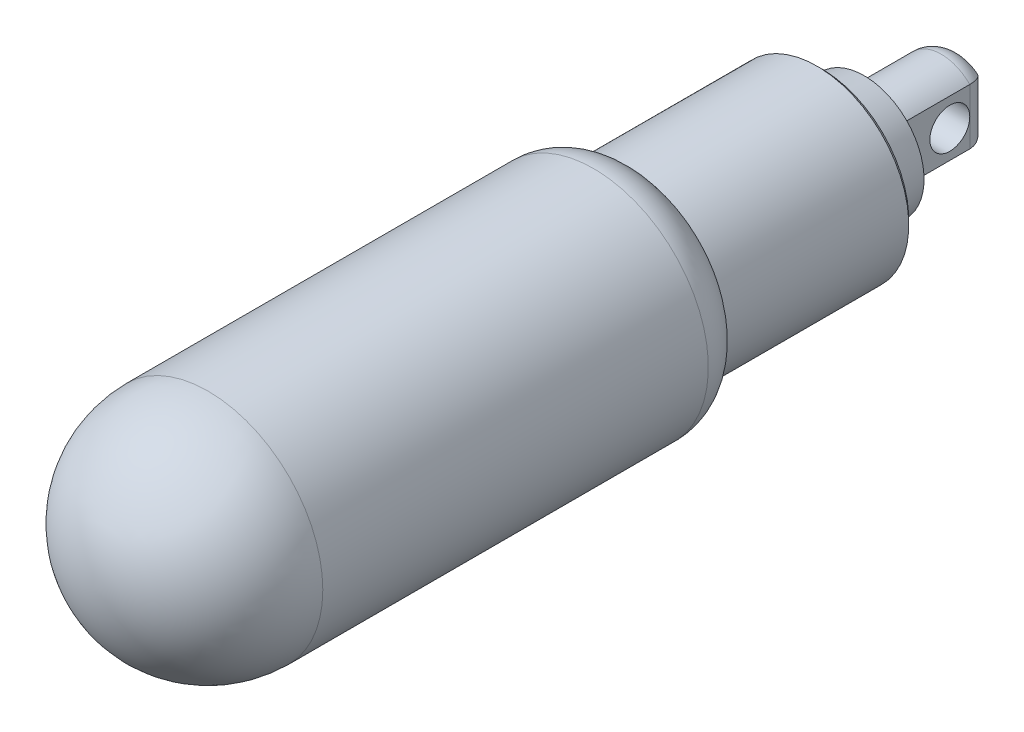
ISO-10303-21;
HEADER;
FILE_DESCRIPTION(('STEP AP214'),'2;1');
FILE_NAME('part.step','',(''),(''),'','','');
FILE_SCHEMA(('AUTOMOTIVE_DESIGN { 1 0 10303 214 1 1 1 1 }'));
ENDSEC;
DATA;
#1=APPLICATION_CONTEXT('core data for automotive mechanical design processes');
#2=APPLICATION_PROTOCOL_DEFINITION('international standard','automotive_design',2000,#1);
#3=PRODUCT_CONTEXT('',#1,'mechanical');
#4=PRODUCT('Part','Part','',(#3));
#5=PRODUCT_RELATED_PRODUCT_CATEGORY('part','',(#4));
#6=PRODUCT_DEFINITION_FORMATION('','',#4);
#7=PRODUCT_DEFINITION_CONTEXT('part definition',#1,'design');
#8=PRODUCT_DEFINITION('design','',#6,#7);
#9=PRODUCT_DEFINITION_SHAPE('','',#8);
#10=(LENGTH_UNIT() NAMED_UNIT(*) SI_UNIT(.MILLI.,.METRE.));
#11=(NAMED_UNIT(*) PLANE_ANGLE_UNIT() SI_UNIT($,.RADIAN.));
#12=(NAMED_UNIT(*) SI_UNIT($,.STERADIAN.) SOLID_ANGLE_UNIT());
#13=UNCERTAINTY_MEASURE_WITH_UNIT(LENGTH_MEASURE(1.E-05),#10,'distance_accuracy_value','');
#14=(GEOMETRIC_REPRESENTATION_CONTEXT(3) GLOBAL_UNCERTAINTY_ASSIGNED_CONTEXT((#13)) GLOBAL_UNIT_ASSIGNED_CONTEXT((#10,
#11,#12)) REPRESENTATION_CONTEXT('',''));
#15=CARTESIAN_POINT('',(0.,0.,0.));
#16=DIRECTION('',(0.,0.,1.));
#17=DIRECTION('',(1.,0.,0.));
#18=AXIS2_PLACEMENT_3D('',#15,#16,#17);
#19=CARTESIAN_POINT('',(0.,0.,-4.));
#20=DIRECTION('',(0.,0.,-1.));
#21=DIRECTION('',(-1.,0.,0.));
#22=AXIS2_PLACEMENT_3D('',#19,#20,#21);
#23=CYLINDRICAL_SURFACE('',#22,4.);
#24=DIRECTION('',(0.,0.,-1.));
#25=VECTOR('',#24,1.);
#26=CARTESIAN_POINT('',(-2.85714285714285,2.79941684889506,-4.));
#27=LINE('',#26,#25);
#28=CARTESIAN_POINT('',(-2.85714285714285,2.79941684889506,5.725));
#29=VERTEX_POINT('',#28);
#30=CARTESIAN_POINT('',(-2.85714285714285,2.79941684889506,-2.));
#31=VERTEX_POINT('',#30);
#32=EDGE_CURVE('E348',#29,#31,#27,.T.);
#33=ORIENTED_EDGE('',*,*,#32,.F.);
#34=CARTESIAN_POINT('',(0.,0.,5.725));
#35=DIRECTION('',(0.,0.,-1.));
#36=DIRECTION('',(-1.,0.,0.));
#37=AXIS2_PLACEMENT_3D('',#34,#35,#36);
#38=CIRCLE('',#37,4.);
#39=CARTESIAN_POINT('',(2.85714285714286,2.79941684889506,5.725));
#40=VERTEX_POINT('',#39);
#41=EDGE_CURVE('E101',#29,#40,#38,.T.);
#42=ORIENTED_EDGE('',*,*,#41,.T.);
#43=DIRECTION('',(0.,0.,-1.));
#44=VECTOR('',#43,1.);
#45=CARTESIAN_POINT('',(2.85714285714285,2.79941684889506,-4.));
#46=LINE('',#45,#44);
#47=CARTESIAN_POINT('',(2.85714285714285,2.79941684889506,-2.));
#48=VERTEX_POINT('',#47);
#49=EDGE_CURVE('E90',#48,#40,#46,.F.);
#50=ORIENTED_EDGE('',*,*,#49,.F.);
#51=CARTESIAN_POINT('',(0.,0.,-2.));
#52=DIRECTION('',(0.,0.,-1.));
#53=DIRECTION('',(-1.,0.,0.));
#54=AXIS2_PLACEMENT_3D('',#51,#52,#53);
#55=CIRCLE('',#54,4.);
#56=EDGE_CURVE('E99',#31,#48,#55,.T.);
#57=ORIENTED_EDGE('',*,*,#56,.F.);
#58=EDGE_LOOP('',(#33,#42,#50,#57));
#59=FACE_BOUND('',#58,.T.);
#60=ADVANCED_FACE('F14',(#59),#23,.T.);
#61=DIRECTION('',(0.,0.,-1.));
#62=VECTOR('',#61,1.);
#63=CARTESIAN_POINT('',(2.85714285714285,-2.79941684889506,-4.));
#64=LINE('',#63,#62);
#65=CARTESIAN_POINT('',(2.85714285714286,-2.79941684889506,5.725));
#66=VERTEX_POINT('',#65);
#67=CARTESIAN_POINT('',(2.85714285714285,-2.79941684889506,-2.));
#68=VERTEX_POINT('',#67);
#69=EDGE_CURVE('E102',#66,#68,#64,.T.);
#70=ORIENTED_EDGE('',*,*,#69,.F.);
#71=CARTESIAN_POINT('',(-2.85714285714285,-2.79941684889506,5.725));
#72=VERTEX_POINT('',#71);
#73=EDGE_CURVE('E116',#66,#72,#38,.T.);
#74=ORIENTED_EDGE('',*,*,#73,.T.);
#75=DIRECTION('',(0.,0.,-1.));
#76=VECTOR('',#75,1.);
#77=CARTESIAN_POINT('',(-2.85714285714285,-2.79941684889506,-4.));
#78=LINE('',#77,#76);
#79=CARTESIAN_POINT('',(-2.85714285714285,-2.79941684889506,-2.));
#80=VERTEX_POINT('',#79);
#81=EDGE_CURVE('E347',#80,#72,#78,.F.);
#82=ORIENTED_EDGE('',*,*,#81,.F.);
#83=EDGE_CURVE('E107',#68,#80,#55,.T.);
#84=ORIENTED_EDGE('',*,*,#83,.F.);
#85=EDGE_LOOP('',(#70,#74,#82,#84));
#86=FACE_BOUND('',#85,.T.);
#87=ADVANCED_FACE('F156',(#86),#23,.T.);
#88=CARTESIAN_POINT('',(0.,0.,-2.));
#89=DIRECTION('',(0.,0.,-1.));
#90=DIRECTION('',(-1.,0.,0.));
#91=AXIS2_PLACEMENT_3D('',#88,#89,#90);
#92=DEGENERATE_TOROIDAL_SURFACE('',#91,2.,2.,.T.);
#93=CARTESIAN_POINT('',(-2.85714284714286,2.79941684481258,-1.9998));
#94=CARTESIAN_POINT('',(-2.85715542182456,2.79942031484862,-2.05279635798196));
#95=CARTESIAN_POINT('',(-2.8550471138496,2.79856122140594,-2.10578949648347));
#96=CARTESIAN_POINT('',(-2.84664432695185,2.79512852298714,-2.21137855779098));
#97=CARTESIAN_POINT('',(-2.84035052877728,2.79255519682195,-2.26397454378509));
#98=CARTESIAN_POINT('',(-2.82365184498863,2.78571264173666,-2.36827407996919));
#99=CARTESIAN_POINT('',(-2.81325659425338,2.7814473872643,-2.41997942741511));
#100=CARTESIAN_POINT('',(-2.78847303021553,2.77124535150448,-2.52224127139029));
#101=CARTESIAN_POINT('',(-2.77408468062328,2.76530855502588,-2.57279775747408));
#102=CARTESIAN_POINT('',(-2.72512915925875,2.74502738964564,-2.72220510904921));
#103=CARTESIAN_POINT('',(-2.68475474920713,2.72820548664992,-2.81889700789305));
#104=CARTESIAN_POINT('',(-2.59013913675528,2.68827772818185,-3.00375750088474));
#105=CARTESIAN_POINT('',(-2.53589468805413,2.66517040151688,-3.09192409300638));
#106=CARTESIAN_POINT('',(-2.41405218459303,2.61240657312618,-3.25977799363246));
#107=CARTESIAN_POINT('',(-2.34616139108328,2.5826044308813,-3.33920686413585));
#108=CARTESIAN_POINT('',(-2.20033087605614,2.51724404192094,-3.48543577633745));
#109=CARTESIAN_POINT('',(-2.12238897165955,2.48168454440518,-3.55223306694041));
#110=CARTESIAN_POINT('',(-1.95361946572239,2.40274760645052,-3.67612715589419));
#111=CARTESIAN_POINT('',(-1.86228163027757,2.3590099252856,-3.73229774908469));
#112=CARTESIAN_POINT('',(-1.67409597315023,2.26600763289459,-3.82859836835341));
#113=CARTESIAN_POINT('',(-1.57724451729,2.21673935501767,-3.86871767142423));
#114=CARTESIAN_POINT('',(-1.37743781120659,2.11126396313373,-3.93410112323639));
#115=CARTESIAN_POINT('',(-1.27438880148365,2.05486922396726,-3.95876963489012));
#116=CARTESIAN_POINT('',(-1.06871316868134,1.93709935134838,-3.99149493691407));
#117=CARTESIAN_POINT('',(-0.966086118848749,1.87573339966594,-3.99958165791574));
#118=CARTESIAN_POINT('',(-0.862445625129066,1.81036723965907,-3.9999947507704));
#119=CARTESIAN_POINT('',(-0.859793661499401,1.80869232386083,-4.00000002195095));
#120=CARTESIAN_POINT('',(-0.857142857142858,1.80701580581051,-4.00000000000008));
#121=B_SPLINE_CURVE_WITH_KNOTS('',3,(#93,#94,#95,#96,#97,#98,#99,#100,#101,#102,#103,#104,#105,
#106,#107,#108,#109,#110,#111,#112,#113,#114,#115,#116,#117,#118,#119,#120),.UNSPECIFIED.,.F.,
.F.,(4,2,2,2,2,2,2,2,2,2,2,2,2,4),(0.,0.158933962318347,0.317842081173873,0.47637910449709,
0.634917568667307,0.951684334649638,1.26852530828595,1.59307370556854,1.91769270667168,
2.26364888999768,2.60983580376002,2.96865805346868,3.32683204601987,3.33624183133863),.UNSPECIFIED.);
#122=CARTESIAN_POINT('',(-0.857142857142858,1.80701580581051,-4.));
#123=VERTEX_POINT('',#122);
#124=EDGE_CURVE('E82',#31,#123,#121,.T.);
#125=ORIENTED_EDGE('',*,*,#124,.F.);
#126=ORIENTED_EDGE('',*,*,#56,.T.);
#127=CARTESIAN_POINT('',(0.857142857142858,1.80701580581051,-4.00000000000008));
#128=CARTESIAN_POINT('',(0.859793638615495,1.80869231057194,-4.00000003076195));
#129=CARTESIAN_POINT('',(0.862445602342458,1.81036722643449,-3.99999475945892));
#130=CARTESIAN_POINT('',(0.98493822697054,1.88762339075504,-3.99950612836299));
#131=CARTESIAN_POINT('',(1.10713295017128,1.9599563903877,-3.98818986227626));
#132=CARTESIAN_POINT('',(1.35141205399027,2.09757398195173,-3.94196004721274));
#133=CARTESIAN_POINT('',(1.4734953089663,2.16283963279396,-3.90698482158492));
#134=CARTESIAN_POINT('',(1.70967891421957,2.28419816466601,-3.81354930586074));
#135=CARTESIAN_POINT('',(1.82389269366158,2.34045405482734,-3.75559438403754));
#136=CARTESIAN_POINT('',(2.04162715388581,2.44446367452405,-3.61667366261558));
#137=CARTESIAN_POINT('',(2.14516108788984,2.49222799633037,-3.53573686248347));
#138=CARTESIAN_POINT('',(2.32546106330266,2.57350420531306,-3.36302609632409));
#139=CARTESIAN_POINT('',(2.40392824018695,2.60801507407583,-3.27349649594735));
#140=CARTESIAN_POINT('',(2.54467757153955,2.66898102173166,-3.08004838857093));
#141=CARTESIAN_POINT('',(2.60696433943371,2.69543839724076,-2.97613399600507));
#142=CARTESIAN_POINT('',(2.70743191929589,2.73768931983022,-2.76723066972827));
#143=CARTESIAN_POINT('',(2.74728640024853,2.75423226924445,-2.66319351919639));
#144=CARTESIAN_POINT('',(2.80921752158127,2.77981241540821,-2.44917306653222));
#145=CARTESIAN_POINT('',(2.83132756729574,2.7888637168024,-2.33920135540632));
#146=CARTESIAN_POINT('',(2.84844348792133,2.79586333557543,-2.19023504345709));
#147=CARTESIAN_POINT('',(2.85170969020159,2.797197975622,-2.15220141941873));
#148=CARTESIAN_POINT('',(2.8560583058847,2.79897424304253,-2.07605126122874));
#149=CARTESIAN_POINT('',(2.8571442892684,2.79941733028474,-2.03793496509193));
#150=CARTESIAN_POINT('',(2.85714284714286,2.79941684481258,-1.9998));
#151=B_SPLINE_CURVE_WITH_KNOTS('',3,(#127,#128,#129,#130,#131,#132,#133,#134,#135,#136,#137,
#138,#139,#140,#141,#142,#143,#144,#145,#146,#147,#148,#149,#150),.UNSPECIFIED.,.F.,.F.,(4,2,2,
2,2,2,2,2,2,2,2,4),(0.,0.00940978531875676,0.434443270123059,0.860589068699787,1.27784118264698,
1.69456911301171,2.0644032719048,2.43413186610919,2.7703358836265,3.10590547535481,
3.22044242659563,3.3347916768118),.UNSPECIFIED.);
#152=CARTESIAN_POINT('',(0.857142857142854,1.80701580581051,-4.));
#153=VERTEX_POINT('',#152);
#154=EDGE_CURVE('E71',#153,#48,#151,.T.);
#155=ORIENTED_EDGE('',*,*,#154,.F.);
#156=CARTESIAN_POINT('',(0.,0.,-4.));
#157=DIRECTION('',(0.,0.,-1.));
#158=DIRECTION('',(-1.,0.,0.));
#159=AXIS2_PLACEMENT_3D('',#156,#157,#158);
#160=CIRCLE('',#159,2.);
#161=EDGE_CURVE('E112',#123,#153,#160,.T.);
#162=ORIENTED_EDGE('',*,*,#161,.F.);
#163=EDGE_LOOP('',(#125,#126,#155,#162));
#164=FACE_BOUND('',#163,.T.);
#165=ADVANCED_FACE('F106',(#164),#92,.T.);
#166=CARTESIAN_POINT('',(0.,-2.,-4.));
#167=DIRECTION('',(0.,0.,1.));
#168=DIRECTION('',(1.,0.,0.));
#169=AXIS2_PLACEMENT_3D('',#166,#167,#168);
#170=PLANE('',#169);
#171=CARTESIAN_POINT('',(0.857142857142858,-1.80701580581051,-4.));
#172=VERTEX_POINT('',#171);
#173=CARTESIAN_POINT('',(-0.857142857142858,-1.80701580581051,-4.));
#174=VERTEX_POINT('',#173);
#175=EDGE_CURVE('E108',#172,#174,#160,.T.);
#176=ORIENTED_EDGE('',*,*,#175,.T.);
#177=DIRECTION('',(0.,-1.,0.));
#178=VECTOR('',#177,1.);
#179=CARTESIAN_POINT('',(-0.857142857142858,11.5,-4.));
#180=LINE('',#179,#178);
#181=EDGE_CURVE('E9',#174,#123,#180,.F.);
#182=ORIENTED_EDGE('',*,*,#181,.T.);
#183=ORIENTED_EDGE('',*,*,#161,.T.);
#184=DIRECTION('',(0.,-1.,0.));
#185=VECTOR('',#184,1.);
#186=CARTESIAN_POINT('',(0.857142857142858,11.5,-4.));
#187=LINE('',#186,#185);
#188=EDGE_CURVE('E22',#172,#153,#187,.F.);
#189=ORIENTED_EDGE('',*,*,#188,.F.);
#190=EDGE_LOOP('',(#176,#182,#183,#189));
#191=FACE_BOUND('',#190,.T.);
#192=ADVANCED_FACE('F144',(#191),#170,.F.);
#193=CARTESIAN_POINT('',(0.,0.,71.5));
#194=DIRECTION('',(0.,0.,-1.));
#195=DIRECTION('',(0.,-1.,0.));
#196=AXIS2_PLACEMENT_3D('',#193,#194,#195);
#197=SPHERICAL_SURFACE('',#196,11.5);
#198=CARTESIAN_POINT('',(0.,0.,71.5));
#199=DIRECTION('',(0.,0.,-1.));
#200=DIRECTION('',(-1.,0.,0.));
#201=AXIS2_PLACEMENT_3D('',#198,#199,#200);
#202=CIRCLE('',#201,11.5);
#203=CARTESIAN_POINT('',(-11.5,0.,71.5));
#204=VERTEX_POINT('',#203);
#205=EDGE_CURVE('E137',#204,#204,#202,.T.);
#206=ORIENTED_EDGE('',*,*,#205,.F.);
#207=EDGE_LOOP('',(#206));
#208=FACE_BOUND('',#207,.T.);
#209=ADVANCED_FACE('F16',(#208),#197,.T.);
#210=CARTESIAN_POINT('',(0.,0.,-4.));
#211=DIRECTION('',(0.,0.,-1.));
#212=DIRECTION('',(-1.,0.,0.));
#213=AXIS2_PLACEMENT_3D('',#210,#211,#212);
#214=CYLINDRICAL_SURFACE('',#213,11.5);
#215=CARTESIAN_POINT('',(0.,0.,32.85));
#216=DIRECTION('',(0.,0.,-1.));
#217=DIRECTION('',(-1.,0.,0.));
#218=AXIS2_PLACEMENT_3D('',#215,#216,#217);
#219=CIRCLE('',#218,11.5);
#220=CARTESIAN_POINT('',(-11.5,0.,32.85));
#221=VERTEX_POINT('',#220);
#222=EDGE_CURVE('E134',#221,#221,#219,.T.);
#223=ORIENTED_EDGE('',*,*,#222,.F.);
#224=EDGE_LOOP('',(#223));
#225=FACE_BOUND('',#224,.T.);
#226=ORIENTED_EDGE('',*,*,#205,.T.);
#227=EDGE_LOOP('',(#226));
#228=FACE_BOUND('',#227,.T.);
#229=ADVANCED_FACE('F141',(#225,#228),#214,.T.);
#230=CARTESIAN_POINT('',(0.,0.,32.85));
#231=DIRECTION('',(0.,0.,-1.));
#232=DIRECTION('',(-1.,0.,0.));
#233=AXIS2_PLACEMENT_3D('',#230,#231,#232);
#234=TOROIDAL_SURFACE('',#233,6.9,4.6);
#235=ORIENTED_EDGE('',*,*,#222,.T.);
#236=EDGE_LOOP('',(#235));
#237=FACE_BOUND('',#236,.T.);
#238=CARTESIAN_POINT('',(0.,0.,28.8662831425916));
#239=DIRECTION('',(0.,0.,-1.));
#240=DIRECTION('',(-1.,0.,0.));
#241=AXIS2_PLACEMENT_3D('',#238,#239,#240);
#242=CIRCLE('',#241,9.2);
#243=CARTESIAN_POINT('',(-9.2,0.,28.8662831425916));
#244=VERTEX_POINT('',#243);
#245=EDGE_CURVE('E131',#244,#244,#242,.T.);
#246=ORIENTED_EDGE('',*,*,#245,.F.);
#247=EDGE_LOOP('',(#246));
#248=FACE_BOUND('',#247,.T.);
#249=ADVANCED_FACE('F151',(#237,#248),#234,.T.);
#250=CARTESIAN_POINT('',(0.,0.,-4.));
#251=DIRECTION('',(0.,0.,-1.));
#252=DIRECTION('',(-1.,0.,0.));
#253=AXIS2_PLACEMENT_3D('',#250,#251,#252);
#254=CYLINDRICAL_SURFACE('',#253,9.2);
#255=CARTESIAN_POINT('',(0.,0.,10.46));
#256=DIRECTION('',(0.,0.,-1.));
#257=DIRECTION('',(-1.,0.,0.));
#258=AXIS2_PLACEMENT_3D('',#255,#256,#257);
#259=CIRCLE('',#258,9.2);
#260=CARTESIAN_POINT('',(-9.2,0.,10.46));
#261=VERTEX_POINT('',#260);
#262=EDGE_CURVE('E128',#261,#261,#259,.T.);
#263=ORIENTED_EDGE('',*,*,#262,.F.);
#264=EDGE_LOOP('',(#263));
#265=FACE_BOUND('',#264,.T.);
#266=ORIENTED_EDGE('',*,*,#245,.T.);
#267=EDGE_LOOP('',(#266));
#268=FACE_BOUND('',#267,.T.);
#269=ADVANCED_FACE('F182',(#265,#268),#254,.T.);
#270=CARTESIAN_POINT('',(0.,0.,10.46));
#271=DIRECTION('',(0.,0.,1.));
#272=DIRECTION('',(1.,0.,0.));
#273=AXIS2_PLACEMENT_3D('',#270,#271,#272);
#274=CONICAL_SURFACE('',#273,9.2,0.785398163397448);
#275=CARTESIAN_POINT('',(0.,0.,10.));
#276=DIRECTION('',(0.,0.,-1.));
#277=DIRECTION('',(-1.,0.,0.));
#278=AXIS2_PLACEMENT_3D('',#275,#276,#277);
#279=CIRCLE('',#278,8.74);
#280=CARTESIAN_POINT('',(-8.74,0.,10.));
#281=VERTEX_POINT('',#280);
#282=EDGE_CURVE('E125',#281,#281,#279,.T.);
#283=ORIENTED_EDGE('',*,*,#282,.F.);
#284=EDGE_LOOP('',(#283));
#285=FACE_BOUND('',#284,.T.);
#286=ORIENTED_EDGE('',*,*,#262,.T.);
#287=EDGE_LOOP('',(#286));
#288=FACE_BOUND('',#287,.T.);
#289=ADVANCED_FACE('F178',(#285,#288),#274,.T.);
#290=CARTESIAN_POINT('',(0.,-8.74,10.));
#291=DIRECTION('',(0.,0.,1.));
#292=DIRECTION('',(1.,0.,0.));
#293=AXIS2_PLACEMENT_3D('',#290,#291,#292);
#294=PLANE('',#293);
#295=CARTESIAN_POINT('',(0.,0.,10.));
#296=DIRECTION('',(0.,0.,-1.));
#297=DIRECTION('',(-1.,0.,0.));
#298=AXIS2_PLACEMENT_3D('',#295,#296,#297);
#299=CIRCLE('',#298,6.60081206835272);
#300=CARTESIAN_POINT('',(-6.60081206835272,0.,10.));
#301=VERTEX_POINT('',#300);
#302=EDGE_CURVE('E122',#301,#301,#299,.T.);
#303=ORIENTED_EDGE('',*,*,#302,.F.);
#304=EDGE_LOOP('',(#303));
#305=FACE_BOUND('',#304,.T.);
#306=ORIENTED_EDGE('',*,*,#282,.T.);
#307=EDGE_LOOP('',(#306));
#308=FACE_BOUND('',#307,.T.);
#309=ADVANCED_FACE('F174',(#305,#308),#294,.F.);
#310=CARTESIAN_POINT('',(0.,0.,10.));
#311=DIRECTION('',(0.,0.,1.));
#312=DIRECTION('',(1.,0.,0.));
#313=AXIS2_PLACEMENT_3D('',#310,#311,#312);
#314=CONICAL_SURFACE('',#313,6.60081206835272,0.139626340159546);
#315=CARTESIAN_POINT('',(0.,0.,5.725));
#316=DIRECTION('',(0.,0.,-1.));
#317=DIRECTION('',(-1.,0.,0.));
#318=AXIS2_PLACEMENT_3D('',#315,#316,#317);
#319=CIRCLE('',#318,6.);
#320=CARTESIAN_POINT('',(-6.,0.,5.725));
#321=VERTEX_POINT('',#320);
#322=EDGE_CURVE('E119',#321,#321,#319,.T.);
#323=ORIENTED_EDGE('',*,*,#322,.F.);
#324=EDGE_LOOP('',(#323));
#325=FACE_BOUND('',#324,.T.);
#326=ORIENTED_EDGE('',*,*,#302,.T.);
#327=EDGE_LOOP('',(#326));
#328=FACE_BOUND('',#327,.T.);
#329=ADVANCED_FACE('F170',(#325,#328),#314,.T.);
#330=CARTESIAN_POINT('',(0.,-6.,5.725));
#331=DIRECTION('',(0.,0.,1.));
#332=DIRECTION('',(1.,0.,0.));
#333=AXIS2_PLACEMENT_3D('',#330,#331,#332);
#334=PLANE('',#333);
#335=ORIENTED_EDGE('',*,*,#73,.F.);
#336=DIRECTION('',(0.,-1.,0.));
#337=VECTOR('',#336,1.);
#338=CARTESIAN_POINT('',(2.85714285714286,11.5,5.725));
#339=LINE('',#338,#337);
#340=EDGE_CURVE('E356',#40,#66,#339,.T.);
#341=ORIENTED_EDGE('',*,*,#340,.F.);
#342=ORIENTED_EDGE('',*,*,#41,.F.);
#343=DIRECTION('',(0.,-1.,0.));
#344=VECTOR('',#343,1.);
#345=CARTESIAN_POINT('',(-2.85714285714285,11.5,5.725));
#346=LINE('',#345,#344);
#347=EDGE_CURVE('E362',#29,#72,#346,.T.);
#348=ORIENTED_EDGE('',*,*,#347,.T.);
#349=EDGE_LOOP('',(#335,#341,#342,#348));
#350=FACE_BOUND('',#349,.T.);
#351=ORIENTED_EDGE('',*,*,#322,.T.);
#352=EDGE_LOOP('',(#351));
#353=FACE_BOUND('',#352,.T.);
#354=ADVANCED_FACE('F167',(#350,#353),#334,.F.);
#355=CARTESIAN_POINT('',(2.85714284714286,-2.79941684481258,-1.9998));
#356=CARTESIAN_POINT('',(2.85715542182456,-2.79942031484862,-2.05279635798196));
#357=CARTESIAN_POINT('',(2.8550471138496,-2.79856122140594,-2.10578949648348));
#358=CARTESIAN_POINT('',(2.84664432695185,-2.79512852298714,-2.21137855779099));
#359=CARTESIAN_POINT('',(2.84035052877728,-2.79255519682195,-2.2639745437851));
#360=CARTESIAN_POINT('',(2.82365184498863,-2.78571264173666,-2.36827407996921));
#361=CARTESIAN_POINT('',(2.81325659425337,-2.7814473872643,-2.41997942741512));
#362=CARTESIAN_POINT('',(2.78847303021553,-2.77124535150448,-2.5222412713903));
#363=CARTESIAN_POINT('',(2.77408468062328,-2.76530855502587,-2.57279775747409));
#364=CARTESIAN_POINT('',(2.72512915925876,-2.74502738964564,-2.72220510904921));
#365=CARTESIAN_POINT('',(2.68475474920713,-2.72820548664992,-2.81889700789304));
#366=CARTESIAN_POINT('',(2.59013913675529,-2.68827772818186,-3.00375750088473));
#367=CARTESIAN_POINT('',(2.53589468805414,-2.66517040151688,-3.09192409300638));
#368=CARTESIAN_POINT('',(2.41405218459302,-2.61240657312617,-3.25977799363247));
#369=CARTESIAN_POINT('',(2.34616139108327,-2.58260443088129,-3.33920686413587));
#370=CARTESIAN_POINT('',(2.20033087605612,-2.51724404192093,-3.48543577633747));
#371=CARTESIAN_POINT('',(2.12238897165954,-2.48168454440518,-3.55223306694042));
#372=CARTESIAN_POINT('',(1.95361946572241,-2.40274760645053,-3.67612715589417));
#373=CARTESIAN_POINT('',(1.86228163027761,-2.35900992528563,-3.73229774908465));
#374=CARTESIAN_POINT('',(1.67409597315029,-2.26600763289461,-3.8285983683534));
#375=CARTESIAN_POINT('',(1.57724451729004,-2.21673935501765,-3.86871767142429));
#376=CARTESIAN_POINT('',(1.37743781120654,-2.11126396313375,-3.93410112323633));
#377=CARTESIAN_POINT('',(1.27438880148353,-2.05486922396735,-3.95876963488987));
#378=CARTESIAN_POINT('',(1.06871316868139,-1.93709935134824,-3.99149493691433));
#379=CARTESIAN_POINT('',(0.966086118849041,-1.87573339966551,-3.99958165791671));
#380=CARTESIAN_POINT('',(0.862445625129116,-1.81036723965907,-3.99999475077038));
#381=CARTESIAN_POINT('',(0.859793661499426,-1.80869232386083,-4.0000000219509));
#382=CARTESIAN_POINT('',(0.857142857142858,-1.80701580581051,-4.));
#383=B_SPLINE_CURVE_WITH_KNOTS('',3,(#355,#356,#357,#358,#359,#360,#361,#362,#363,#364,#365,
#366,#367,#368,#369,#370,#371,#372,#373,#374,#375,#376,#377,#378,#379,#380,#381,#382),
.UNSPECIFIED.,.F.,.F.,(4,2,2,2,2,2,2,2,2,2,2,2,2,4),(0.,0.158933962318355,0.317842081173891,
0.476379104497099,0.634917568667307,0.951684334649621,1.26852530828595,1.59307370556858,
1.91769270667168,2.2636488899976,2.60983580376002,2.96865805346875,3.32683204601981,
3.33624183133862),.UNSPECIFIED.);
#384=EDGE_CURVE('E83',#68,#172,#383,.T.);
#385=ORIENTED_EDGE('',*,*,#384,.F.);
#386=ORIENTED_EDGE('',*,*,#83,.T.);
#387=CARTESIAN_POINT('',(-0.857142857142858,-1.80701580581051,-4.));
#388=CARTESIAN_POINT('',(-0.85979363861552,-1.80869231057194,-4.0000000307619));
#389=CARTESIAN_POINT('',(-0.862445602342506,-1.8103672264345,-3.9999947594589));
#390=CARTESIAN_POINT('',(-0.984938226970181,-1.88762339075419,-3.99950612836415));
#391=CARTESIAN_POINT('',(-1.10713295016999,-1.95995639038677,-3.9881898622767));
#392=CARTESIAN_POINT('',(-1.35141205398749,-2.09757398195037,-3.94196004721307));
#393=CARTESIAN_POINT('',(-1.47349530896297,-2.16283963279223,-3.90698482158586));
#394=CARTESIAN_POINT('',(-1.70967891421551,-2.28419816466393,-3.81354930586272));
#395=CARTESIAN_POINT('',(-1.82389269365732,-2.34045405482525,-3.75559438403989));
#396=CARTESIAN_POINT('',(-2.04162715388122,-2.44446367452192,-3.61667366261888));
#397=CARTESIAN_POINT('',(-2.14516108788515,-2.49222799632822,-3.53573686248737));
#398=CARTESIAN_POINT('',(-2.32546106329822,-2.57350420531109,-3.36302609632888));
#399=CARTESIAN_POINT('',(-2.40392824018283,-2.60801507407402,-3.27349649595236));
#400=CARTESIAN_POINT('',(-2.54467757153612,-2.66898102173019,-3.08004838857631));
#401=CARTESIAN_POINT('',(-2.60696433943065,-2.69543839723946,-2.97613399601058));
#402=CARTESIAN_POINT('',(-2.70743191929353,-2.73768931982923,-2.76723066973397));
#403=CARTESIAN_POINT('',(-2.74728640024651,-2.75423226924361,-2.66319351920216));
#404=CARTESIAN_POINT('',(-2.80921752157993,-2.77981241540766,-2.44917306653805));
#405=CARTESIAN_POINT('',(-2.83132756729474,-2.78886371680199,-2.33920135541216));
#406=CARTESIAN_POINT('',(-2.84844348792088,-2.79586333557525,-2.19023504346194));
#407=CARTESIAN_POINT('',(-2.85170969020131,-2.79719797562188,-2.15220141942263));
#408=CARTESIAN_POINT('',(-2.85605830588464,-2.79897424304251,-2.0760512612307));
#409=CARTESIAN_POINT('',(-2.8571442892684,-2.79941733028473,-2.0379349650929));
#410=CARTESIAN_POINT('',(-2.85714284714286,-2.79941684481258,-1.9998));
#411=B_SPLINE_CURVE_WITH_KNOTS('',3,(#387,#388,#389,#390,#391,#392,#393,#394,#395,#396,#397,
#398,#399,#400,#401,#402,#403,#404,#405,#406,#407,#408,#409,#410),.UNSPECIFIED.,.F.,.F.,(4,2,2,
2,2,2,2,2,2,2,2,4),(0.,0.00940978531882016,0.434443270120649,0.860589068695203,1.27784118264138,
1.69456911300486,2.06440327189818,2.4341318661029,2.77033588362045,3.10590547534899,
3.22044242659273,3.33479167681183),.UNSPECIFIED.);
#412=EDGE_CURVE('E103',#174,#80,#411,.T.);
#413=ORIENTED_EDGE('',*,*,#412,.F.);
#414=ORIENTED_EDGE('',*,*,#175,.F.);
#415=EDGE_LOOP('',(#385,#386,#413,#414));
#416=FACE_BOUND('',#415,.T.);
#417=ADVANCED_FACE('F165',(#416),#92,.T.);
#418=CARTESIAN_POINT('',(0.857142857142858,11.5,-2.));
#419=DIRECTION('',(0.,-1.,0.));
#420=DIRECTION('',(1.,0.,0.));
#421=AXIS2_PLACEMENT_3D('',#418,#419,#420);
#422=CYLINDRICAL_SURFACE('',#421,2.);
#423=ORIENTED_EDGE('',*,*,#154,.T.);
#424=DIRECTION('',(0.,-1.,0.));
#425=VECTOR('',#424,1.);
#426=CARTESIAN_POINT('',(2.85714285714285,11.5,-2.));
#427=LINE('',#426,#425);
#428=CARTESIAN_POINT('',(2.85714285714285,0.,-2.));
#429=VERTEX_POINT('',#428);
#430=EDGE_CURVE('E75',#48,#429,#427,.T.);
#431=ORIENTED_EDGE('',*,*,#430,.T.);
#432=EDGE_CURVE('E93',#429,#68,#427,.T.);
#433=ORIENTED_EDGE('',*,*,#432,.T.);
#434=ORIENTED_EDGE('',*,*,#384,.T.);
#435=ORIENTED_EDGE('',*,*,#188,.T.);
#436=EDGE_LOOP('',(#423,#431,#433,#434,#435));
#437=FACE_BOUND('',#436,.T.);
#438=ADVANCED_FACE('F73',(#437),#422,.T.);
#439=CARTESIAN_POINT('',(2.85714285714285,11.5,-2.));
#440=DIRECTION('',(1.,0.,0.));
#441=DIRECTION('',(0.,0.,-1.));
#442=AXIS2_PLACEMENT_3D('',#439,#440,#441);
#443=PLANE('',#442);
#444=ORIENTED_EDGE('',*,*,#432,.F.);
#445=CARTESIAN_POINT('',(2.85714285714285,0.,0.));
#446=DIRECTION('',(1.,0.,0.));
#447=DIRECTION('',(0.,0.,-1.));
#448=AXIS2_PLACEMENT_3D('',#445,#446,#447);
#449=CIRCLE('',#448,2.);
#450=EDGE_CURVE('E27',#429,#429,#449,.F.);
#451=ORIENTED_EDGE('',*,*,#450,.T.);
#452=ORIENTED_EDGE('',*,*,#430,.F.);
#453=ORIENTED_EDGE('',*,*,#49,.T.);
#454=ORIENTED_EDGE('',*,*,#340,.T.);
#455=ORIENTED_EDGE('',*,*,#69,.T.);
#456=EDGE_LOOP('',(#444,#451,#452,#453,#454,#455));
#457=FACE_BOUND('',#456,.T.);
#458=ADVANCED_FACE('F88',(#457),#443,.T.);
#459=CARTESIAN_POINT('',(-2.85714285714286,11.5,5.725));
#460=DIRECTION('',(-1.,0.,0.));
#461=DIRECTION('',(0.,0.,1.));
#462=AXIS2_PLACEMENT_3D('',#459,#460,#461);
#463=PLANE('',#462);
#464=DIRECTION('',(0.,-1.,0.));
#465=VECTOR('',#464,1.);
#466=CARTESIAN_POINT('',(-2.85714285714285,11.5,-2.));
#467=LINE('',#466,#465);
#468=CARTESIAN_POINT('',(-2.85714285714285,0.,-2.));
#469=VERTEX_POINT('',#468);
#470=EDGE_CURVE('E361',#31,#469,#467,.T.);
#471=ORIENTED_EDGE('',*,*,#470,.T.);
#472=CARTESIAN_POINT('',(-2.85714285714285,0.,0.));
#473=DIRECTION('',(-1.,0.,0.));
#474=DIRECTION('',(0.,0.,1.));
#475=AXIS2_PLACEMENT_3D('',#472,#473,#474);
#476=CIRCLE('',#475,2.);
#477=EDGE_CURVE('E32',#469,#469,#476,.F.);
#478=ORIENTED_EDGE('',*,*,#477,.T.);
#479=EDGE_CURVE('E92',#469,#80,#467,.T.);
#480=ORIENTED_EDGE('',*,*,#479,.T.);
#481=ORIENTED_EDGE('',*,*,#81,.T.);
#482=ORIENTED_EDGE('',*,*,#347,.F.);
#483=ORIENTED_EDGE('',*,*,#32,.T.);
#484=EDGE_LOOP('',(#471,#478,#480,#481,#482,#483));
#485=FACE_BOUND('',#484,.T.);
#486=ADVANCED_FACE('F249',(#485),#463,.T.);
#487=CARTESIAN_POINT('',(-0.857142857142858,11.5,-2.));
#488=DIRECTION('',(0.,-1.,0.));
#489=DIRECTION('',(1.,0.,0.));
#490=AXIS2_PLACEMENT_3D('',#487,#488,#489);
#491=CYLINDRICAL_SURFACE('',#490,2.);
#492=ORIENTED_EDGE('',*,*,#412,.T.);
#493=ORIENTED_EDGE('',*,*,#479,.F.);
#494=ORIENTED_EDGE('',*,*,#470,.F.);
#495=ORIENTED_EDGE('',*,*,#124,.T.);
#496=ORIENTED_EDGE('',*,*,#181,.F.);
#497=EDGE_LOOP('',(#492,#493,#494,#495,#496));
#498=FACE_BOUND('',#497,.T.);
#499=ADVANCED_FACE('F257',(#498),#491,.T.);
#500=CARTESIAN_POINT('',(-11.5,0.,0.));
#501=DIRECTION('',(1.,0.,0.));
#502=DIRECTION('',(0.,0.,-1.));
#503=AXIS2_PLACEMENT_3D('',#500,#501,#502);
#504=CYLINDRICAL_SURFACE('',#503,2.);
#505=ORIENTED_EDGE('',*,*,#450,.F.);
#506=EDGE_LOOP('',(#505));
#507=FACE_BOUND('',#506,.T.);
#508=ORIENTED_EDGE('',*,*,#477,.F.);
#509=EDGE_LOOP('',(#508));
#510=FACE_BOUND('',#509,.T.);
#511=ADVANCED_FACE('F266',(#507,#510),#504,.F.);
#512=CLOSED_SHELL('',(#60,#87,#165,#192,#209,#229,#249,#269,#289,#309,#329,#354,#417,#438,#458,
#486,#499,#511));
#513=MANIFOLD_SOLID_BREP('B1',#512);
#514=ADVANCED_BREP_SHAPE_REPRESENTATION('',(#18,#513),#14);
#515=SHAPE_DEFINITION_REPRESENTATION(#9,#514);
ENDSEC;
END-ISO-10303-21;
